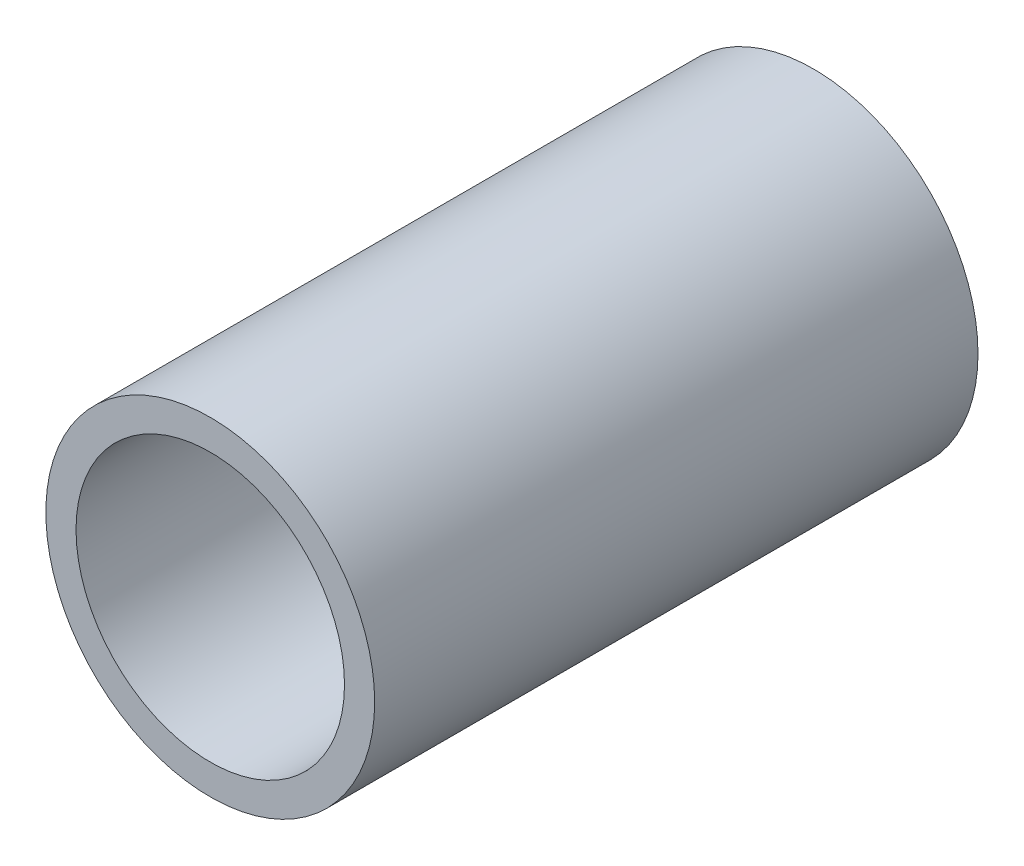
ISO-10303-21;
HEADER;
FILE_DESCRIPTION(('STEP AP214'),'2;1');
FILE_NAME('part.step','',(''),(''),'','','');
FILE_SCHEMA(('AUTOMOTIVE_DESIGN { 1 0 10303 214 1 1 1 1 }'));
ENDSEC;
DATA;
#1=APPLICATION_CONTEXT('core data for automotive mechanical design processes');
#2=APPLICATION_PROTOCOL_DEFINITION('international standard','automotive_design',2000,#1);
#3=PRODUCT_CONTEXT('',#1,'mechanical');
#4=PRODUCT('Part','Part','',(#3));
#5=PRODUCT_RELATED_PRODUCT_CATEGORY('part','',(#4));
#6=PRODUCT_DEFINITION_FORMATION('','',#4);
#7=PRODUCT_DEFINITION_CONTEXT('part definition',#1,'design');
#8=PRODUCT_DEFINITION('design','',#6,#7);
#9=PRODUCT_DEFINITION_SHAPE('','',#8);
#10=(LENGTH_UNIT() NAMED_UNIT(*) SI_UNIT(.MILLI.,.METRE.));
#11=(NAMED_UNIT(*) PLANE_ANGLE_UNIT() SI_UNIT($,.RADIAN.));
#12=(NAMED_UNIT(*) SI_UNIT($,.STERADIAN.) SOLID_ANGLE_UNIT());
#13=UNCERTAINTY_MEASURE_WITH_UNIT(LENGTH_MEASURE(1.E-05),#10,'distance_accuracy_value','');
#14=(GEOMETRIC_REPRESENTATION_CONTEXT(3) GLOBAL_UNCERTAINTY_ASSIGNED_CONTEXT((#13)) GLOBAL_UNIT_ASSIGNED_CONTEXT((#10,
#11,#12)) REPRESENTATION_CONTEXT('',''));
#15=CARTESIAN_POINT('',(0.,0.,0.));
#16=DIRECTION('',(0.,0.,1.));
#17=DIRECTION('',(1.,0.,0.));
#18=AXIS2_PLACEMENT_3D('',#15,#16,#17);
#19=CARTESIAN_POINT('',(0.,0.,127.));
#20=DIRECTION('',(0.,0.,1.));
#21=DIRECTION('',(1.,0.,0.));
#22=AXIS2_PLACEMENT_3D('',#19,#20,#21);
#23=PLANE('',#22);
#24=CARTESIAN_POINT('',(0.,0.,127.));
#25=DIRECTION('',(0.,0.,1.));
#26=DIRECTION('',(1.,0.,0.));
#27=AXIS2_PLACEMENT_3D('',#24,#25,#26);
#28=CIRCLE('',#27,34.6075);
#29=CARTESIAN_POINT('',(34.6075,0.,127.));
#30=VERTEX_POINT('',#29);
#31=EDGE_CURVE('E10',#30,#30,#28,.T.);
#32=ORIENTED_EDGE('',*,*,#31,.T.);
#33=EDGE_LOOP('',(#32));
#34=FACE_BOUND('',#33,.T.);
#35=CARTESIAN_POINT('',(0.,0.,127.));
#36=DIRECTION('',(0.,0.,1.));
#37=DIRECTION('',(1.,0.,0.));
#38=AXIS2_PLACEMENT_3D('',#35,#36,#37);
#39=CIRCLE('',#38,28.2575);
#40=CARTESIAN_POINT('',(28.2575,0.,127.));
#41=VERTEX_POINT('',#40);
#42=EDGE_CURVE('E52',#41,#41,#39,.T.);
#43=ORIENTED_EDGE('',*,*,#42,.F.);
#44=EDGE_LOOP('',(#43));
#45=FACE_BOUND('',#44,.T.);
#46=ADVANCED_FACE('F41',(#34,#45),#23,.T.);
#47=CARTESIAN_POINT('',(0.,0.,0.));
#48=DIRECTION('',(0.,0.,1.));
#49=DIRECTION('',(1.,0.,0.));
#50=AXIS2_PLACEMENT_3D('',#47,#48,#49);
#51=PLANE('',#50);
#52=CARTESIAN_POINT('',(0.,0.,0.));
#53=DIRECTION('',(0.,0.,1.));
#54=DIRECTION('',(1.,0.,0.));
#55=AXIS2_PLACEMENT_3D('',#52,#53,#54);
#56=CIRCLE('',#55,34.6075);
#57=CARTESIAN_POINT('',(34.6075,0.,0.));
#58=VERTEX_POINT('',#57);
#59=EDGE_CURVE('E45',#58,#58,#56,.T.);
#60=ORIENTED_EDGE('',*,*,#59,.F.);
#61=EDGE_LOOP('',(#60));
#62=FACE_BOUND('',#61,.T.);
#63=CARTESIAN_POINT('',(0.,0.,0.));
#64=DIRECTION('',(0.,0.,1.));
#65=DIRECTION('',(1.,0.,0.));
#66=AXIS2_PLACEMENT_3D('',#63,#64,#65);
#67=CIRCLE('',#66,28.2575);
#68=CARTESIAN_POINT('',(28.2575,0.,0.));
#69=VERTEX_POINT('',#68);
#70=EDGE_CURVE('E54',#69,#69,#67,.T.);
#71=ORIENTED_EDGE('',*,*,#70,.T.);
#72=EDGE_LOOP('',(#71));
#73=FACE_BOUND('',#72,.T.);
#74=ADVANCED_FACE('F64',(#62,#73),#51,.F.);
#75=CARTESIAN_POINT('',(0.,0.,127.));
#76=DIRECTION('',(0.,0.,-1.));
#77=DIRECTION('',(-1.,0.,0.));
#78=AXIS2_PLACEMENT_3D('',#75,#76,#77);
#79=CYLINDRICAL_SURFACE('',#78,34.6075);
#80=ORIENTED_EDGE('',*,*,#31,.F.);
#81=EDGE_LOOP('',(#80));
#82=FACE_BOUND('',#81,.T.);
#83=ORIENTED_EDGE('',*,*,#59,.T.);
#84=EDGE_LOOP('',(#83));
#85=FACE_BOUND('',#84,.T.);
#86=ADVANCED_FACE('F43',(#82,#85),#79,.T.);
#87=CARTESIAN_POINT('',(0.,0.,127.));
#88=DIRECTION('',(0.,0.,-1.));
#89=DIRECTION('',(-1.,0.,0.));
#90=AXIS2_PLACEMENT_3D('',#87,#88,#89);
#91=CYLINDRICAL_SURFACE('',#90,28.2575);
#92=ORIENTED_EDGE('',*,*,#42,.T.);
#93=EDGE_LOOP('',(#92));
#94=FACE_BOUND('',#93,.T.);
#95=ORIENTED_EDGE('',*,*,#70,.F.);
#96=EDGE_LOOP('',(#95));
#97=FACE_BOUND('',#96,.T.);
#98=ADVANCED_FACE('F60',(#94,#97),#91,.F.);
#99=CLOSED_SHELL('',(#46,#74,#86,#98));
#100=MANIFOLD_SOLID_BREP('B2',#99);
#101=ADVANCED_BREP_SHAPE_REPRESENTATION('',(#18,#100),#14);
#102=SHAPE_DEFINITION_REPRESENTATION(#9,#101);
ENDSEC;
END-ISO-10303-21;
